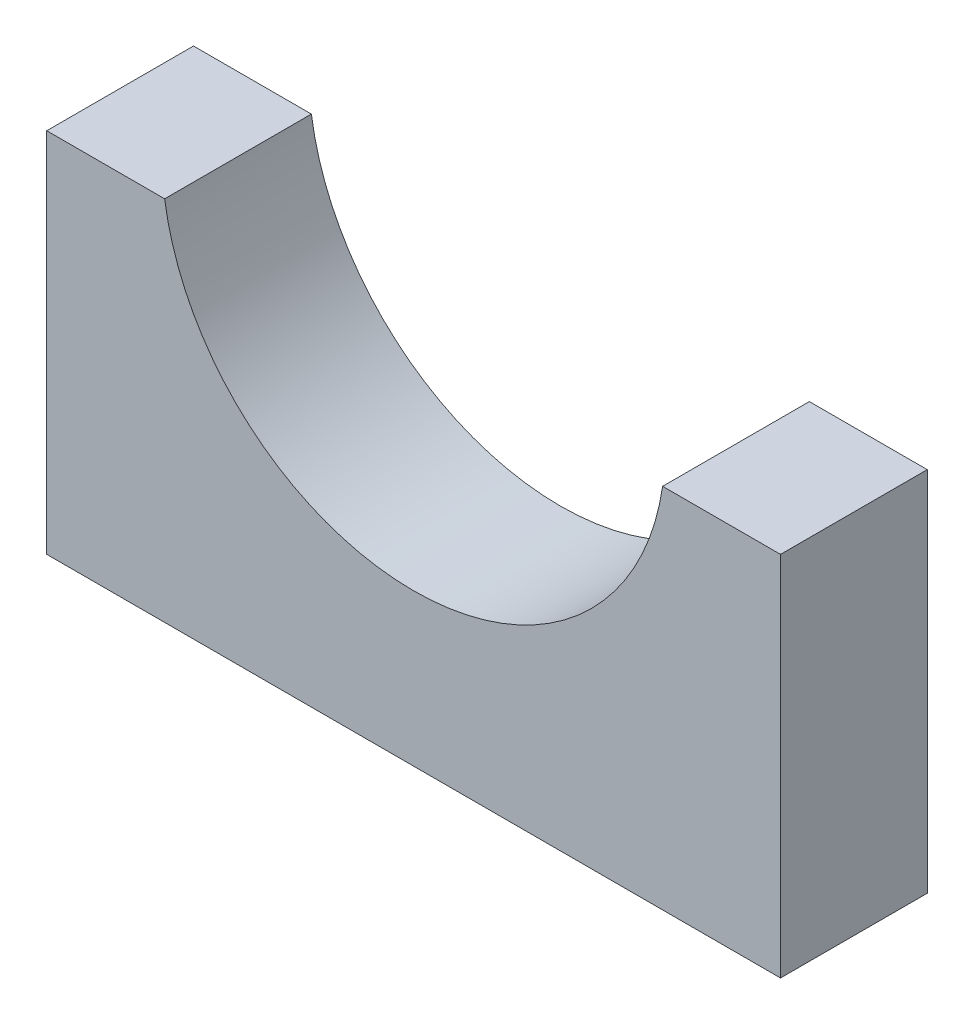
ISO-10303-21;
HEADER;
FILE_DESCRIPTION(('STEP AP214'),'2;1');
FILE_NAME('part.step','',(''),(''),'','','');
FILE_SCHEMA(('AUTOMOTIVE_DESIGN { 1 0 10303 214 1 1 1 1 }'));
ENDSEC;
DATA;
#1=APPLICATION_CONTEXT('core data for automotive mechanical design processes');
#2=APPLICATION_PROTOCOL_DEFINITION('international standard','automotive_design',2000,#1);
#3=PRODUCT_CONTEXT('',#1,'mechanical');
#4=PRODUCT('Part','Part','',(#3));
#5=PRODUCT_RELATED_PRODUCT_CATEGORY('part','',(#4));
#6=PRODUCT_DEFINITION_FORMATION('','',#4);
#7=PRODUCT_DEFINITION_CONTEXT('part definition',#1,'design');
#8=PRODUCT_DEFINITION('design','',#6,#7);
#9=PRODUCT_DEFINITION_SHAPE('','',#8);
#10=(LENGTH_UNIT() NAMED_UNIT(*) SI_UNIT(.MILLI.,.METRE.));
#11=(NAMED_UNIT(*) PLANE_ANGLE_UNIT() SI_UNIT($,.RADIAN.));
#12=(NAMED_UNIT(*) SI_UNIT($,.STERADIAN.) SOLID_ANGLE_UNIT());
#13=UNCERTAINTY_MEASURE_WITH_UNIT(LENGTH_MEASURE(1.E-05),#10,'distance_accuracy_value','');
#14=(GEOMETRIC_REPRESENTATION_CONTEXT(3) GLOBAL_UNCERTAINTY_ASSIGNED_CONTEXT((#13)) GLOBAL_UNIT_ASSIGNED_CONTEXT((#10,
#11,#12)) REPRESENTATION_CONTEXT('',''));
#15=CARTESIAN_POINT('',(0.,0.,0.));
#16=DIRECTION('',(0.,0.,1.));
#17=DIRECTION('',(1.,0.,0.));
#18=AXIS2_PLACEMENT_3D('',#15,#16,#17);
#19=CARTESIAN_POINT('',(0.,19.05,6.35));
#20=DIRECTION('',(0.,0.,-1.));
#21=DIRECTION('',(-1.,0.,0.));
#22=AXIS2_PLACEMENT_3D('',#19,#20,#21);
#23=CYLINDRICAL_SURFACE('',#22,21.7805);
#24=CARTESIAN_POINT('',(0.,19.05,-6.35));
#25=DIRECTION('',(0.,0.,1.));
#26=DIRECTION('',(1.,0.,0.));
#27=AXIS2_PLACEMENT_3D('',#24,#25,#26);
#28=CIRCLE('',#27,21.7805);
#29=CARTESIAN_POINT('',(-21.5478434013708,15.875,-6.35));
#30=VERTEX_POINT('',#29);
#31=CARTESIAN_POINT('',(21.5478434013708,15.875,-6.35));
#32=VERTEX_POINT('',#31);
#33=EDGE_CURVE('E125',#30,#32,#28,.T.);
#34=ORIENTED_EDGE('',*,*,#33,.F.);
#35=DIRECTION('',(0.,0.,-1.));
#36=VECTOR('',#35,1.);
#37=CARTESIAN_POINT('',(-21.5478434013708,15.875,6.35));
#38=LINE('',#37,#36);
#39=CARTESIAN_POINT('',(-21.5478434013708,15.875,6.35));
#40=VERTEX_POINT('',#39);
#41=EDGE_CURVE('E12',#40,#30,#38,.T.);
#42=ORIENTED_EDGE('',*,*,#41,.F.);
#43=CARTESIAN_POINT('',(0.,19.05,6.35));
#44=DIRECTION('',(0.,0.,1.));
#45=DIRECTION('',(1.,0.,0.));
#46=AXIS2_PLACEMENT_3D('',#43,#44,#45);
#47=CIRCLE('',#46,21.7805);
#48=CARTESIAN_POINT('',(21.5478434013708,15.875,6.35));
#49=VERTEX_POINT('',#48);
#50=EDGE_CURVE('E137',#40,#49,#47,.T.);
#51=ORIENTED_EDGE('',*,*,#50,.T.);
#52=DIRECTION('',(0.,0.,-1.));
#53=VECTOR('',#52,1.);
#54=CARTESIAN_POINT('',(21.5478434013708,15.875,6.35));
#55=LINE('',#54,#53);
#56=EDGE_CURVE('E55',#49,#32,#55,.T.);
#57=ORIENTED_EDGE('',*,*,#56,.T.);
#58=EDGE_LOOP('',(#34,#42,#51,#57));
#59=FACE_BOUND('',#58,.T.);
#60=ADVANCED_FACE('F39',(#59),#23,.F.);
#61=CARTESIAN_POINT('',(0.,15.875,6.35));
#62=DIRECTION('',(0.,1.,0.));
#63=DIRECTION('',(0.,0.,1.));
#64=AXIS2_PLACEMENT_3D('',#61,#62,#63);
#65=PLANE('',#64);
#66=DIRECTION('',(1.,0.,0.));
#67=VECTOR('',#66,1.);
#68=CARTESIAN_POINT('',(0.,15.875,-6.35));
#69=LINE('',#68,#67);
#70=CARTESIAN_POINT('',(-31.75,15.875,-6.35));
#71=VERTEX_POINT('',#70);
#72=EDGE_CURVE('E144',#71,#30,#69,.T.);
#73=ORIENTED_EDGE('',*,*,#72,.F.);
#74=DIRECTION('',(0.,0.,-1.));
#75=VECTOR('',#74,1.);
#76=CARTESIAN_POINT('',(-31.75,15.875,6.35));
#77=LINE('',#76,#75);
#78=CARTESIAN_POINT('',(-31.75,15.875,6.35));
#79=VERTEX_POINT('',#78);
#80=EDGE_CURVE('E47',#79,#71,#77,.T.);
#81=ORIENTED_EDGE('',*,*,#80,.F.);
#82=DIRECTION('',(1.,0.,0.));
#83=VECTOR('',#82,1.);
#84=CARTESIAN_POINT('',(0.,15.875,6.35));
#85=LINE('',#84,#83);
#86=EDGE_CURVE('E120',#79,#40,#85,.T.);
#87=ORIENTED_EDGE('',*,*,#86,.T.);
#88=ORIENTED_EDGE('',*,*,#41,.T.);
#89=EDGE_LOOP('',(#73,#81,#87,#88));
#90=FACE_BOUND('',#89,.T.);
#91=ADVANCED_FACE('F156',(#90),#65,.T.);
#92=CARTESIAN_POINT('',(-31.75,0.,6.35));
#93=DIRECTION('',(-1.,0.,0.));
#94=DIRECTION('',(0.,0.,1.));
#95=AXIS2_PLACEMENT_3D('',#92,#93,#94);
#96=PLANE('',#95);
#97=DIRECTION('',(0.,1.,0.));
#98=VECTOR('',#97,1.);
#99=CARTESIAN_POINT('',(-31.75,0.,-6.35));
#100=LINE('',#99,#98);
#101=CARTESIAN_POINT('',(-31.75,-15.875,-6.35));
#102=VERTEX_POINT('',#101);
#103=EDGE_CURVE('E149',#102,#71,#100,.T.);
#104=ORIENTED_EDGE('',*,*,#103,.F.);
#105=DIRECTION('',(0.,0.,-1.));
#106=VECTOR('',#105,1.);
#107=CARTESIAN_POINT('',(-31.75,-15.875,6.35));
#108=LINE('',#107,#106);
#109=CARTESIAN_POINT('',(-31.75,-15.875,6.35));
#110=VERTEX_POINT('',#109);
#111=EDGE_CURVE('E113',#110,#102,#108,.T.);
#112=ORIENTED_EDGE('',*,*,#111,.F.);
#113=DIRECTION('',(0.,1.,0.));
#114=VECTOR('',#113,1.);
#115=CARTESIAN_POINT('',(-31.75,0.,6.35));
#116=LINE('',#115,#114);
#117=EDGE_CURVE('E102',#110,#79,#116,.T.);
#118=ORIENTED_EDGE('',*,*,#117,.T.);
#119=ORIENTED_EDGE('',*,*,#80,.T.);
#120=EDGE_LOOP('',(#104,#112,#118,#119));
#121=FACE_BOUND('',#120,.T.);
#122=ADVANCED_FACE('F165',(#121),#96,.T.);
#123=CARTESIAN_POINT('',(0.,-15.875,6.35));
#124=DIRECTION('',(0.,1.,0.));
#125=DIRECTION('',(0.,0.,1.));
#126=AXIS2_PLACEMENT_3D('',#123,#124,#125);
#127=PLANE('',#126);
#128=DIRECTION('',(1.,0.,0.));
#129=VECTOR('',#128,1.);
#130=CARTESIAN_POINT('',(0.,-15.875,-6.35));
#131=LINE('',#130,#129);
#132=CARTESIAN_POINT('',(31.75,-15.875,-6.35));
#133=VERTEX_POINT('',#132);
#134=EDGE_CURVE('E110',#102,#133,#131,.T.);
#135=ORIENTED_EDGE('',*,*,#134,.T.);
#136=DIRECTION('',(0.,0.,-1.));
#137=VECTOR('',#136,1.);
#138=CARTESIAN_POINT('',(31.75,-15.875,6.35));
#139=LINE('',#138,#137);
#140=CARTESIAN_POINT('',(31.75,-15.875,6.35));
#141=VERTEX_POINT('',#140);
#142=EDGE_CURVE('E107',#141,#133,#139,.T.);
#143=ORIENTED_EDGE('',*,*,#142,.F.);
#144=DIRECTION('',(1.,0.,0.));
#145=VECTOR('',#144,1.);
#146=CARTESIAN_POINT('',(0.,-15.875,6.35));
#147=LINE('',#146,#145);
#148=EDGE_CURVE('E94',#110,#141,#147,.T.);
#149=ORIENTED_EDGE('',*,*,#148,.F.);
#150=ORIENTED_EDGE('',*,*,#111,.T.);
#151=EDGE_LOOP('',(#135,#143,#149,#150));
#152=FACE_BOUND('',#151,.T.);
#153=ADVANCED_FACE('F108',(#152),#127,.F.);
#154=CARTESIAN_POINT('',(31.75,0.,6.35));
#155=DIRECTION('',(-1.,0.,0.));
#156=DIRECTION('',(0.,0.,1.));
#157=AXIS2_PLACEMENT_3D('',#154,#155,#156);
#158=PLANE('',#157);
#159=DIRECTION('',(0.,1.,0.));
#160=VECTOR('',#159,1.);
#161=CARTESIAN_POINT('',(31.75,0.,-6.35));
#162=LINE('',#161,#160);
#163=CARTESIAN_POINT('',(31.75,15.875,-6.35));
#164=VERTEX_POINT('',#163);
#165=EDGE_CURVE('E143',#133,#164,#162,.T.);
#166=ORIENTED_EDGE('',*,*,#165,.T.);
#167=DIRECTION('',(0.,0.,-1.));
#168=VECTOR('',#167,1.);
#169=CARTESIAN_POINT('',(31.75,15.875,6.35));
#170=LINE('',#169,#168);
#171=CARTESIAN_POINT('',(31.75,15.875,6.35));
#172=VERTEX_POINT('',#171);
#173=EDGE_CURVE('E75',#172,#164,#170,.T.);
#174=ORIENTED_EDGE('',*,*,#173,.F.);
#175=DIRECTION('',(0.,1.,0.));
#176=VECTOR('',#175,1.);
#177=CARTESIAN_POINT('',(31.75,0.,6.35));
#178=LINE('',#177,#176);
#179=EDGE_CURVE('E99',#141,#172,#178,.T.);
#180=ORIENTED_EDGE('',*,*,#179,.F.);
#181=ORIENTED_EDGE('',*,*,#142,.T.);
#182=EDGE_LOOP('',(#166,#174,#180,#181));
#183=FACE_BOUND('',#182,.T.);
#184=ADVANCED_FACE('F115',(#183),#158,.F.);
#185=EDGE_CURVE('E141',#32,#164,#69,.T.);
#186=ORIENTED_EDGE('',*,*,#185,.F.);
#187=ORIENTED_EDGE('',*,*,#56,.F.);
#188=EDGE_CURVE('E117',#49,#172,#85,.T.);
#189=ORIENTED_EDGE('',*,*,#188,.T.);
#190=ORIENTED_EDGE('',*,*,#173,.T.);
#191=EDGE_LOOP('',(#186,#187,#189,#190));
#192=FACE_BOUND('',#191,.T.);
#193=ADVANCED_FACE('F153',(#192),#65,.T.);
#194=CARTESIAN_POINT('',(0.,0.,6.35));
#195=DIRECTION('',(0.,0.,1.));
#196=DIRECTION('',(1.,0.,0.));
#197=AXIS2_PLACEMENT_3D('',#194,#195,#196);
#198=PLANE('',#197);
#199=ORIENTED_EDGE('',*,*,#50,.F.);
#200=ORIENTED_EDGE('',*,*,#86,.F.);
#201=ORIENTED_EDGE('',*,*,#117,.F.);
#202=ORIENTED_EDGE('',*,*,#148,.T.);
#203=ORIENTED_EDGE('',*,*,#179,.T.);
#204=ORIENTED_EDGE('',*,*,#188,.F.);
#205=EDGE_LOOP('',(#199,#200,#201,#202,#203,#204));
#206=FACE_BOUND('',#205,.T.);
#207=ADVANCED_FACE('F96',(#206),#198,.T.);
#208=CARTESIAN_POINT('',(0.,0.,-6.35));
#209=DIRECTION('',(0.,0.,1.));
#210=DIRECTION('',(1.,0.,0.));
#211=AXIS2_PLACEMENT_3D('',#208,#209,#210);
#212=PLANE('',#211);
#213=ORIENTED_EDGE('',*,*,#33,.T.);
#214=ORIENTED_EDGE('',*,*,#185,.T.);
#215=ORIENTED_EDGE('',*,*,#165,.F.);
#216=ORIENTED_EDGE('',*,*,#134,.F.);
#217=ORIENTED_EDGE('',*,*,#103,.T.);
#218=ORIENTED_EDGE('',*,*,#72,.T.);
#219=EDGE_LOOP('',(#213,#214,#215,#216,#217,#218));
#220=FACE_BOUND('',#219,.T.);
#221=ADVANCED_FACE('F152',(#220),#212,.F.);
#222=CLOSED_SHELL('',(#60,#91,#122,#153,#184,#193,#207,#221));
#223=MANIFOLD_SOLID_BREP('B2',#222);
#224=ADVANCED_BREP_SHAPE_REPRESENTATION('',(#18,#223),#14);
#225=SHAPE_DEFINITION_REPRESENTATION(#9,#224);
ENDSEC;
END-ISO-10303-21;
